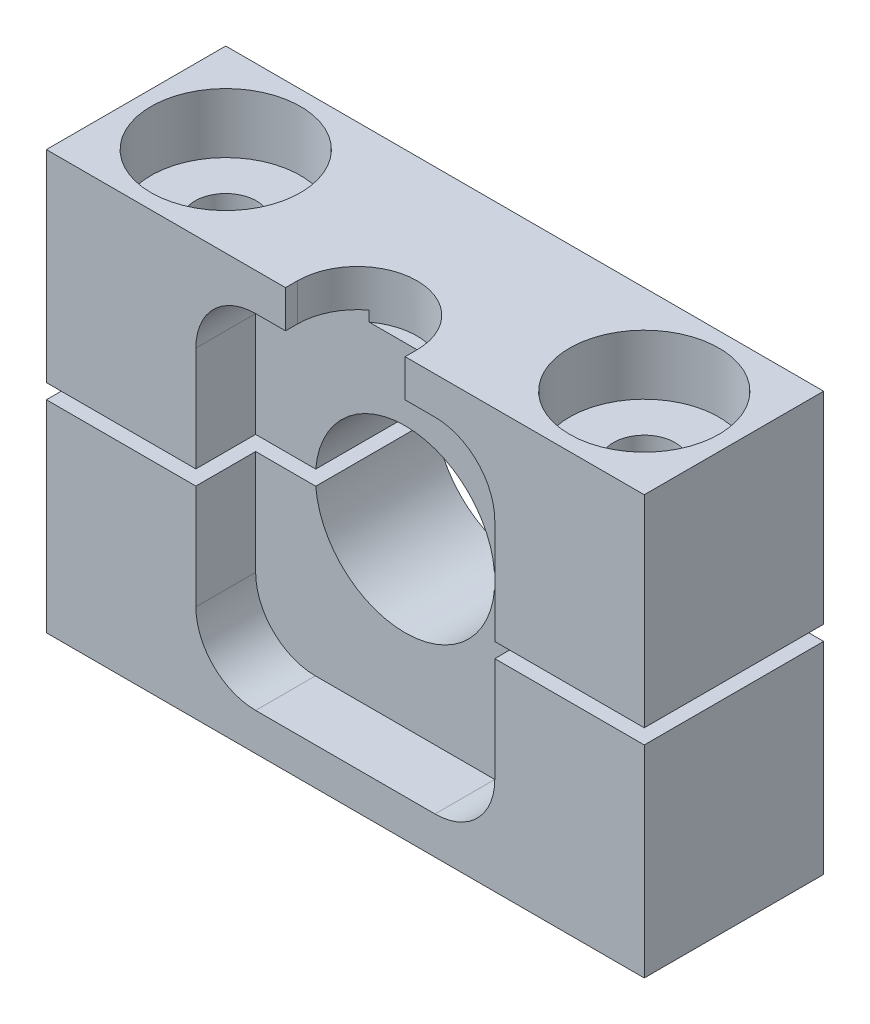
from build123d import *

# Parameters (mm, degrees)
SKETCH1_R                                        = 9.525
BOSS_EXTRUDE1_DEPTH                              = 9.525
CBORE_FOR_1_4_SOCKET_HEAD_CAP_SCREW1_D           = 6.5278
CBORE_FOR_1_4_SOCKET_HEAD_CAP_SCREW1_CBORE_D     = 15.875
CBORE_FOR_1_4_SOCKET_HEAD_CAP_SCREW1_CBORE_DEPTH = 6.35
CUT_EXTRUDE2_DEPTH                               = 6.35
SKETCH6_W                                        = 63.5
SKETCH6_H                                        = 19.05
CUT_EXTRUDE3_DEPTH                               = 0.7874
CUT_EXTRUDE4_DEPTH                               = 5.08


with BuildPart() as part:
    # Sketch1 → Boss-Extrude1 (new, symmetric)
    with BuildSketch(Plane.XY):
        Polygon((31.75, 22.225), (-31.75, 22.225), (-31.75, -22.225), (0, -22.225), (31.75, -22.225), align=None)
        with Locations(Location((0, 0, 0), (0, 0, 180))):
            Circle(SKETCH1_R, mode=Mode.SUBTRACT)
    extrude(amount=BOSS_EXTRUDE1_DEPTH, both=True)

    # CBORE for 1_4 Socket Head Cap Screw1 (through all)
    with Locations(Plane(origin=(0, 22.225, 0), x_dir=(1, 0, 0), z_dir=(0, 1, 0))):
        with Locations((-22.225, 0), (22.225, 0)):
            CounterBoreHole(CBORE_FOR_1_4_SOCKET_HEAD_CAP_SCREW1_D / 2, CBORE_FOR_1_4_SOCKET_HEAD_CAP_SCREW1_CBORE_D / 2, CBORE_FOR_1_4_SOCKET_HEAD_CAP_SCREW1_CBORE_DEPTH)

    # Sketch2 → Cut-Extrude2 (cut)
    with BuildSketch(Plane.XY.offset(9.525)):
        with BuildLine():
            Line((-9.525, 18.2499), (9.525, 18.2499))
            ThreePointArc((9.525, 18.2499), (14.015128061, 16.390028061), (15.875, 11.8999))
            Line((15.875, 11.8999), (15.875, -11.8999))
            ThreePointArc((15.875, -11.8999), (14.015128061, -16.390028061), (9.525, -18.2499))
            Line((9.525, -18.2499), (-9.525, -18.2499))
            ThreePointArc((-9.525, -18.2499), (-14.015128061, -16.390028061), (-15.875, -11.8999))
            Line((-15.875, -11.8999), (-15.875, 11.8999))
            ThreePointArc((-15.875, 11.8999), (-14.015128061, 16.390028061), (-9.525, 18.2499))
        make_face()
    extrude(amount=-CUT_EXTRUDE2_DEPTH, mode=Mode.SUBTRACT)

    # Sketch6 → Cut-Extrude3 (cut, symmetric)
    with BuildSketch(Plane(origin=(0, 0, 0), x_dir=(1, 0, 0), z_dir=(0, 1, 0))):
        Rectangle(SKETCH6_W, SKETCH6_H)
    extrude(amount=CUT_EXTRUDE3_DEPTH, both=True, mode=Mode.SUBTRACT)


with BuildPart() as cut_extrude3_piece_1:
    # of the separate pieces the step leaves, piece 1, a body of its own (cut_extrude3_pieces)
    add(part.part.solids().sort_by_distance((31.75, -22.225, -9.525))[0])


with BuildPart() as cut_extrude3_piece_2:
    # of the separate pieces the step leaves, piece 2, a body of its own (cut_extrude3_pieces)
    add(part.part.solids().sort_by_distance((31.75, 22.225, -9.525))[0])

    # Sketch7 → Cut-Extrude4 (cut)
    with BuildSketch(Plane(origin=(0, 22.225, 0), x_dir=(1, 0, 0), z_dir=(0, 1, 0))):
        with BuildLine():
            Line((6.35, -8.255), (6.35, -18.526689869))
            ThreePointArc((6.35, -18.526689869), (0, -24.876689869), (-6.35, -18.526689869))
            Line((-6.35, -18.526689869), (-6.35, -8.255))
            ThreePointArc((-6.35, -8.255), (0, -1.905), (6.35, -8.255))
        make_face()
    extrude(amount=-CUT_EXTRUDE4_DEPTH, mode=Mode.SUBTRACT)


solid = Compound([cut_extrude3_piece_1.part, cut_extrude3_piece_2.part])
